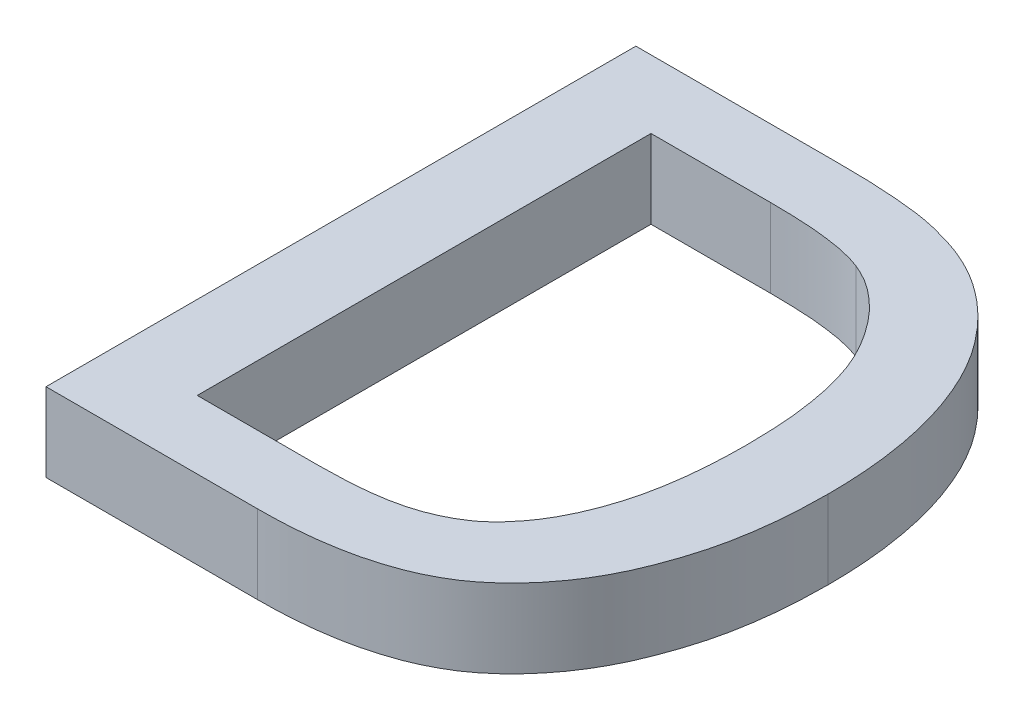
ISO-10303-21;
HEADER;
FILE_DESCRIPTION(('STEP AP214'),'2;1');
FILE_NAME('part.step','',(''),(''),'','','');
FILE_SCHEMA(('AUTOMOTIVE_DESIGN { 1 0 10303 214 1 1 1 1 }'));
ENDSEC;
DATA;
#1=APPLICATION_CONTEXT('core data for automotive mechanical design processes');
#2=APPLICATION_PROTOCOL_DEFINITION('international standard','automotive_design',2000,#1);
#3=PRODUCT_CONTEXT('',#1,'mechanical');
#4=PRODUCT('Part','Part','',(#3));
#5=PRODUCT_RELATED_PRODUCT_CATEGORY('part','',(#4));
#6=PRODUCT_DEFINITION_FORMATION('','',#4);
#7=PRODUCT_DEFINITION_CONTEXT('part definition',#1,'design');
#8=PRODUCT_DEFINITION('design','',#6,#7);
#9=PRODUCT_DEFINITION_SHAPE('','',#8);
#10=(LENGTH_UNIT() NAMED_UNIT(*) SI_UNIT(.MILLI.,.METRE.));
#11=(NAMED_UNIT(*) PLANE_ANGLE_UNIT() SI_UNIT($,.RADIAN.));
#12=(NAMED_UNIT(*) SI_UNIT($,.STERADIAN.) SOLID_ANGLE_UNIT());
#13=UNCERTAINTY_MEASURE_WITH_UNIT(LENGTH_MEASURE(1.E-05),#10,'distance_accuracy_value','');
#14=(GEOMETRIC_REPRESENTATION_CONTEXT(3) GLOBAL_UNCERTAINTY_ASSIGNED_CONTEXT((#13)) GLOBAL_UNIT_ASSIGNED_CONTEXT((#10,
#11,#12)) REPRESENTATION_CONTEXT('',''));
#15=CARTESIAN_POINT('',(0.,0.,0.));
#16=DIRECTION('',(0.,0.,1.));
#17=DIRECTION('',(1.,0.,0.));
#18=AXIS2_PLACEMENT_3D('',#15,#16,#17);
#19=CARTESIAN_POINT('',(4.25445931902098,6.60004762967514,-8.62210329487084));
#20=CARTESIAN_POINT('',(4.25445931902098,6.40004762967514,-8.62210329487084));
#21=CARTESIAN_POINT('',(4.24758374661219,6.60004762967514,-8.62461945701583));
#22=CARTESIAN_POINT('',(4.24758374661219,6.40004762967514,-8.62461945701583));
#23=CARTESIAN_POINT('',(4.23301485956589,6.60004762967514,-8.6299510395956));
#24=CARTESIAN_POINT('',(4.23301485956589,6.40004762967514,-8.6299510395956));
#25=CARTESIAN_POINT('',(4.20923702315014,6.60004762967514,-8.63598558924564));
#26=CARTESIAN_POINT('',(4.20923702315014,6.40004762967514,-8.63598558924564));
#27=CARTESIAN_POINT('',(4.18270071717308,6.60004762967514,-8.64153904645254));
#28=CARTESIAN_POINT('',(4.18270071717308,6.40004762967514,-8.64153904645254));
#29=CARTESIAN_POINT('',(4.15314438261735,6.60004762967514,-8.64543684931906));
#30=CARTESIAN_POINT('',(4.15314438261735,6.40004762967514,-8.64543684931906));
#31=CARTESIAN_POINT('',(4.1207174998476,6.60004762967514,-8.64922508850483));
#32=CARTESIAN_POINT('',(4.1207174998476,6.40004762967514,-8.64922508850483));
#33=CARTESIAN_POINT('',(4.08521850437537,6.60004762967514,-8.65152712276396));
#34=CARTESIAN_POINT('',(4.08521850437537,6.40004762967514,-8.65152712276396));
#35=CARTESIAN_POINT('',(4.04683357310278,6.60004762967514,-8.652570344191));
#36=CARTESIAN_POINT('',(4.04683357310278,6.40004762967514,-8.652570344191));
#37=CARTESIAN_POINT('',(4.02028517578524,6.60004762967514,-8.6528884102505));
#38=CARTESIAN_POINT('',(4.02028517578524,6.40004762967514,-8.6528884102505));
#39=CARTESIAN_POINT('',(4.0065626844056,6.60004762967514,-8.65305281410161));
#40=CARTESIAN_POINT('',(4.0065626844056,6.40004762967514,-8.65305281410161));
#41=(BOUNDED_SURFACE() B_SPLINE_SURFACE(3,1,((#19,#20),(#21,#22),(#23,#24),(#25,#26),(#27,#28),
(#29,#30),(#31,#32),(#33,#34),(#35,#36),(#37,#38),(#39,#40)),.UNSPECIFIED.,.F.,.F.,
.F.) B_SPLINE_SURFACE_WITH_KNOTS((4,1,1,1,1,1,1,1,4),(2,2),(0.,0.0874250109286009,
0.18524786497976,0.292738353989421,0.411206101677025,0.541245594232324,0.682780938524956,
0.836033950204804,1.),(0.,1.),
.UNSPECIFIED.) GEOMETRIC_REPRESENTATION_ITEM() RATIONAL_B_SPLINE_SURFACE(((1.,1.),(1.,1.),(1.,
1.),(1.,1.),(1.,1.),(1.,1.),(1.,1.),(1.,1.),(1.,1.),(1.,1.),(1.,1.))) REPRESENTATION_ITEM('') SURFACE());
#42=CARTESIAN_POINT('',(4.25445931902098,6.40004762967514,-8.62210329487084));
#43=CARTESIAN_POINT('',(4.24758374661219,6.40004762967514,-8.62461945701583));
#44=CARTESIAN_POINT('',(4.23301485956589,6.40004762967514,-8.6299510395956));
#45=CARTESIAN_POINT('',(4.20923702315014,6.40004762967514,-8.63598558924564));
#46=CARTESIAN_POINT('',(4.18270071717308,6.40004762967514,-8.64153904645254));
#47=CARTESIAN_POINT('',(4.15314438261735,6.40004762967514,-8.64543684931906));
#48=CARTESIAN_POINT('',(4.1207174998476,6.40004762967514,-8.64922508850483));
#49=CARTESIAN_POINT('',(4.08521850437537,6.40004762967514,-8.65152712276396));
#50=CARTESIAN_POINT('',(4.04683357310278,6.40004762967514,-8.652570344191));
#51=CARTESIAN_POINT('',(4.02028517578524,6.40004762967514,-8.6528884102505));
#52=CARTESIAN_POINT('',(4.0065626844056,6.40004762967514,-8.65305281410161));
#53=(BOUNDED_CURVE() B_SPLINE_CURVE(3,(#42,#43,#44,#45,#46,#47,#48,#49,#50,#51,#52),
.UNSPECIFIED.,.F.,.F.) B_SPLINE_CURVE_WITH_KNOTS((4,1,1,1,1,1,1,1,4),(0.,0.0874250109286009,
0.18524786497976,0.292738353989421,0.411206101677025,0.541245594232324,0.682780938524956,
0.836033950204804,1.),
.UNSPECIFIED.) CURVE() GEOMETRIC_REPRESENTATION_ITEM() RATIONAL_B_SPLINE_CURVE((1.,1.,1.,1.,1.,
1.,1.,1.,1.,1.,1.)) REPRESENTATION_ITEM(''));
#54=CARTESIAN_POINT('',(4.25445931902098,6.40004762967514,-8.62210329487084));
#55=VERTEX_POINT('',#54);
#56=CARTESIAN_POINT('',(4.0065626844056,6.40004762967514,-8.65305281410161));
#57=VERTEX_POINT('',#56);
#58=EDGE_CURVE('E162',#55,#57,#53,.T.);
#59=DIRECTION('',(0.,-1.,0.));
#60=VECTOR('',#59,1.);
#61=CARTESIAN_POINT('',(4.25445931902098,6.60004762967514,-8.62210329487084));
#62=LINE('',#61,#60);
#63=CARTESIAN_POINT('',(4.25445931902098,6.60004762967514,-8.62210329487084));
#64=VERTEX_POINT('',#63);
#65=EDGE_CURVE('E11',#64,#55,#62,.T.);
#66=CARTESIAN_POINT('',(4.25445931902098,6.60004762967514,-8.62210329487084));
#67=CARTESIAN_POINT('',(4.24758374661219,6.60004762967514,-8.62461945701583));
#68=CARTESIAN_POINT('',(4.23301485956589,6.60004762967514,-8.6299510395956));
#69=CARTESIAN_POINT('',(4.20923702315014,6.60004762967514,-8.63598558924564));
#70=CARTESIAN_POINT('',(4.18270071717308,6.60004762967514,-8.64153904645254));
#71=CARTESIAN_POINT('',(4.15314438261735,6.60004762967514,-8.64543684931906));
#72=CARTESIAN_POINT('',(4.1207174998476,6.60004762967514,-8.64922508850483));
#73=CARTESIAN_POINT('',(4.08521850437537,6.60004762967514,-8.65152712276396));
#74=CARTESIAN_POINT('',(4.04683357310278,6.60004762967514,-8.652570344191));
#75=CARTESIAN_POINT('',(4.02028517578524,6.60004762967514,-8.6528884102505));
#76=CARTESIAN_POINT('',(4.0065626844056,6.60004762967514,-8.65305281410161));
#77=(BOUNDED_CURVE() B_SPLINE_CURVE(3,(#66,#67,#68,#69,#70,#71,#72,#73,#74,#75,#76),
.UNSPECIFIED.,.F.,.F.) B_SPLINE_CURVE_WITH_KNOTS((4,1,1,1,1,1,1,1,4),(0.,0.0874250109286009,
0.18524786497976,0.292738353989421,0.411206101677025,0.541245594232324,0.682780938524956,
0.836033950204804,1.),
.UNSPECIFIED.) CURVE() GEOMETRIC_REPRESENTATION_ITEM() RATIONAL_B_SPLINE_CURVE((1.,1.,1.,1.,1.,
1.,1.,1.,1.,1.,1.)) REPRESENTATION_ITEM(''));
#78=CARTESIAN_POINT('',(4.0065626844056,6.60004762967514,-8.65305281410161));
#79=VERTEX_POINT('',#78);
#80=EDGE_CURVE('E252',#64,#79,#77,.T.);
#81=DIRECTION('',(0.,-1.,0.));
#82=VECTOR('',#81,1.);
#83=CARTESIAN_POINT('',(4.0065626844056,6.60004762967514,-8.65305281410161));
#84=LINE('',#83,#82);
#85=EDGE_CURVE('E200',#79,#57,#84,.T.);
#86=ORIENTED_EDGE('',*,*,#58,.F.);
#87=ORIENTED_EDGE('',*,*,#65,.F.);
#88=ORIENTED_EDGE('',*,*,#80,.T.);
#89=ORIENTED_EDGE('',*,*,#85,.T.);
#90=EDGE_LOOP('',(#86,#87,#88,#89));
#91=FACE_BOUND('',#90,.T.);
#92=ADVANCED_FACE('F16',(#91),#41,.T.);
#93=CARTESIAN_POINT('',(4.51016845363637,6.60004762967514,-8.0875480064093));
#94=CARTESIAN_POINT('',(4.51016845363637,6.40004762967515,-8.0875480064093));
#95=CARTESIAN_POINT('',(4.50991189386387,6.60004762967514,-8.10668177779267));
#96=CARTESIAN_POINT('',(4.50991189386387,6.40004762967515,-8.10668177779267));
#97=CARTESIAN_POINT('',(4.5094131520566,6.60004762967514,-8.14387705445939));
#98=CARTESIAN_POINT('',(4.5094131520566,6.40004762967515,-8.14387705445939));
#99=CARTESIAN_POINT('',(4.50630392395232,6.60004762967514,-8.19806433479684));
#100=CARTESIAN_POINT('',(4.50630392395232,6.40004762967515,-8.19806433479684));
#101=CARTESIAN_POINT('',(4.50016585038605,6.60004762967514,-8.24877820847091));
#102=CARTESIAN_POINT('',(4.50016585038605,6.40004762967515,-8.24877820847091));
#103=CARTESIAN_POINT('',(4.49231582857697,6.60004762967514,-8.29610639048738));
#104=CARTESIAN_POINT('',(4.49231582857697,6.40004762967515,-8.29610639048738));
#105=CARTESIAN_POINT('',(4.48159785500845,6.60004762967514,-8.33989843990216));
#106=CARTESIAN_POINT('',(4.48159785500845,6.40004762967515,-8.33989843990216));
#107=CARTESIAN_POINT('',(4.46934166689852,6.60004762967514,-8.3805739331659));
#108=CARTESIAN_POINT('',(4.46934166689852,6.40004762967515,-8.3805739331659));
#109=CARTESIAN_POINT('',(4.4539229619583,6.60004762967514,-8.41760114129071));
#110=CARTESIAN_POINT('',(4.4539229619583,6.40004762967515,-8.41760114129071));
#111=CARTESIAN_POINT('',(4.43632832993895,6.60004762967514,-8.45126591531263));
#112=CARTESIAN_POINT('',(4.43632832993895,6.40004762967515,-8.45126591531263));
#113=CARTESIAN_POINT('',(4.41702681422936,6.60004762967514,-8.48179182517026));
#114=CARTESIAN_POINT('',(4.41702681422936,6.40004762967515,-8.48179182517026));
#115=CARTESIAN_POINT('',(4.39691394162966,6.60004762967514,-8.50983454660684));
#116=CARTESIAN_POINT('',(4.39691394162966,6.40004762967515,-8.50983454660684));
#117=CARTESIAN_POINT('',(4.3758867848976,6.60004762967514,-8.53530213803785));
#118=CARTESIAN_POINT('',(4.3758867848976,6.40004762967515,-8.53530213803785));
#119=CARTESIAN_POINT('',(4.35349979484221,6.60004762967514,-8.55783224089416));
#120=CARTESIAN_POINT('',(4.35349979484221,6.40004762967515,-8.55783224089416));
#121=CARTESIAN_POINT('',(4.33042595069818,6.60004762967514,-8.5780911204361));
#122=CARTESIAN_POINT('',(4.33042595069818,6.40004762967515,-8.5780911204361));
#123=CARTESIAN_POINT('',(4.30623509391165,6.60004762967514,-8.59566400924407));
#124=CARTESIAN_POINT('',(4.30623509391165,6.40004762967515,-8.59566400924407));
#125=CARTESIAN_POINT('',(4.28099491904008,6.60004762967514,-8.61054550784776));
#126=CARTESIAN_POINT('',(4.28099491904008,6.40004762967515,-8.61054550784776));
#127=CARTESIAN_POINT('',(4.26325880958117,6.60004762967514,-8.61827060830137));
#128=CARTESIAN_POINT('',(4.26325880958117,6.40004762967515,-8.61827060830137));
#129=CARTESIAN_POINT('',(4.25445931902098,6.60004762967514,-8.62210329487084));
#130=CARTESIAN_POINT('',(4.25445931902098,6.40004762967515,-8.62210329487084));
#131=(BOUNDED_SURFACE() B_SPLINE_SURFACE(3,1,((#93,#94),(#95,#96),(#97,#98),(#99,#100),(#101,
#102),(#103,#104),(#105,#106),(#107,#108),(#109,#110),(#111,#112),(#113,#114),(#115,#116),(#117,
#118),(#119,#120),(#121,#122),(#123,#124),(#125,#126),(#127,#128),(#129,#130)),.UNSPECIFIED.,
.F.,.F.,.F.) B_SPLINE_SURFACE_WITH_KNOTS((4,1,1,1,1,1,1,1,1,1,1,1,1,1,1,1,4),(2,2),(0.,
0.0912579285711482,0.177401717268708,0.258693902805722,0.334791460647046,0.406045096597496,
0.473581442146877,0.537187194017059,0.597012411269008,0.654533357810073,0.709286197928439,
0.76151799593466,0.811847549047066,0.860604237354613,0.907805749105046,0.954259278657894,1.),
(0.,1.),.UNSPECIFIED.) GEOMETRIC_REPRESENTATION_ITEM() RATIONAL_B_SPLINE_SURFACE(((1.,1.),(1.,
1.),(1.,1.),(1.,1.),(1.,1.),(1.,1.),(1.,1.),(1.,1.),(1.,1.),(1.,1.),(1.,1.),(1.,1.),(1.,1.),(1.,
1.),(1.,1.),(1.,1.),(1.,1.),(1.,1.),(1.,1.))) REPRESENTATION_ITEM('') SURFACE());
#132=CARTESIAN_POINT('',(4.51016845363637,6.40004762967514,-8.0875480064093));
#133=CARTESIAN_POINT('',(4.50991189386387,6.40004762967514,-8.10668177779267));
#134=CARTESIAN_POINT('',(4.5094131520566,6.40004762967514,-8.14387705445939));
#135=CARTESIAN_POINT('',(4.50630392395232,6.40004762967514,-8.19806433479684));
#136=CARTESIAN_POINT('',(4.50016585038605,6.40004762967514,-8.24877820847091));
#137=CARTESIAN_POINT('',(4.49231582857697,6.40004762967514,-8.29610639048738));
#138=CARTESIAN_POINT('',(4.48159785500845,6.40004762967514,-8.33989843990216));
#139=CARTESIAN_POINT('',(4.46934166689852,6.40004762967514,-8.3805739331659));
#140=CARTESIAN_POINT('',(4.4539229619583,6.40004762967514,-8.41760114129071));
#141=CARTESIAN_POINT('',(4.43632832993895,6.40004762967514,-8.45126591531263));
#142=CARTESIAN_POINT('',(4.41702681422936,6.40004762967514,-8.48179182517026));
#143=CARTESIAN_POINT('',(4.39691394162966,6.40004762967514,-8.50983454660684));
#144=CARTESIAN_POINT('',(4.3758867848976,6.40004762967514,-8.53530213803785));
#145=CARTESIAN_POINT('',(4.35349979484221,6.40004762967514,-8.55783224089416));
#146=CARTESIAN_POINT('',(4.33042595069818,6.40004762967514,-8.5780911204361));
#147=CARTESIAN_POINT('',(4.30623509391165,6.40004762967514,-8.59566400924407));
#148=CARTESIAN_POINT('',(4.28099491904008,6.40004762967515,-8.61054550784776));
#149=CARTESIAN_POINT('',(4.26325880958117,6.40004762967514,-8.61827060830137));
#150=CARTESIAN_POINT('',(4.25445931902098,6.40004762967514,-8.62210329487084));
#151=(BOUNDED_CURVE() B_SPLINE_CURVE(3,(#132,#133,#134,#135,#136,#137,#138,#139,#140,#141,#142,
#143,#144,#145,#146,#147,#148,#149,#150),.UNSPECIFIED.,.F.,.F.) B_SPLINE_CURVE_WITH_KNOTS((4,1,
1,1,1,1,1,1,1,1,1,1,1,1,1,1,4),(0.,0.0912579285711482,0.177401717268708,0.258693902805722,
0.334791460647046,0.406045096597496,0.473581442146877,0.537187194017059,0.597012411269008,
0.654533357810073,0.709286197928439,0.76151799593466,0.811847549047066,0.860604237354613,
0.907805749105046,0.954259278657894,1.),
.UNSPECIFIED.) CURVE() GEOMETRIC_REPRESENTATION_ITEM() RATIONAL_B_SPLINE_CURVE((1.,1.,1.,1.,1.,
1.,1.,1.,1.,1.,1.,1.,1.,1.,1.,1.,1.,1.,1.)) REPRESENTATION_ITEM(''));
#152=CARTESIAN_POINT('',(4.51016845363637,6.40004762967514,-8.0875480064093));
#153=VERTEX_POINT('',#152);
#154=EDGE_CURVE('E347',#153,#55,#151,.T.);
#155=DIRECTION('',(0.,-1.,0.));
#156=VECTOR('',#155,1.);
#157=CARTESIAN_POINT('',(4.51016845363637,6.60004762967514,-8.0875480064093));
#158=LINE('',#157,#156);
#159=CARTESIAN_POINT('',(4.51016845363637,6.60004762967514,-8.0875480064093));
#160=VERTEX_POINT('',#159);
#161=EDGE_CURVE('E26',#160,#153,#158,.T.);
#162=CARTESIAN_POINT('',(4.51016845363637,6.60004762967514,-8.0875480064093));
#163=CARTESIAN_POINT('',(4.50991189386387,6.60004762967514,-8.10668177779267));
#164=CARTESIAN_POINT('',(4.5094131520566,6.60004762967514,-8.14387705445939));
#165=CARTESIAN_POINT('',(4.50630392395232,6.60004762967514,-8.19806433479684));
#166=CARTESIAN_POINT('',(4.50016585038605,6.60004762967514,-8.24877820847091));
#167=CARTESIAN_POINT('',(4.49231582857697,6.60004762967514,-8.29610639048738));
#168=CARTESIAN_POINT('',(4.48159785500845,6.60004762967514,-8.33989843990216));
#169=CARTESIAN_POINT('',(4.46934166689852,6.60004762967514,-8.3805739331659));
#170=CARTESIAN_POINT('',(4.4539229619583,6.60004762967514,-8.41760114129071));
#171=CARTESIAN_POINT('',(4.43632832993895,6.60004762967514,-8.45126591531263));
#172=CARTESIAN_POINT('',(4.41702681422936,6.60004762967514,-8.48179182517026));
#173=CARTESIAN_POINT('',(4.39691394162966,6.60004762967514,-8.50983454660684));
#174=CARTESIAN_POINT('',(4.3758867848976,6.60004762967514,-8.53530213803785));
#175=CARTESIAN_POINT('',(4.35349979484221,6.60004762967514,-8.55783224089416));
#176=CARTESIAN_POINT('',(4.33042595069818,6.60004762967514,-8.5780911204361));
#177=CARTESIAN_POINT('',(4.30623509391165,6.60004762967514,-8.59566400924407));
#178=CARTESIAN_POINT('',(4.28099491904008,6.60004762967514,-8.61054550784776));
#179=CARTESIAN_POINT('',(4.26325880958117,6.60004762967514,-8.61827060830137));
#180=CARTESIAN_POINT('',(4.25445931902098,6.60004762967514,-8.62210329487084));
#181=(BOUNDED_CURVE() B_SPLINE_CURVE(3,(#162,#163,#164,#165,#166,#167,#168,#169,#170,#171,#172,
#173,#174,#175,#176,#177,#178,#179,#180),.UNSPECIFIED.,.F.,.F.) B_SPLINE_CURVE_WITH_KNOTS((4,1,
1,1,1,1,1,1,1,1,1,1,1,1,1,1,4),(0.,0.0912579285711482,0.177401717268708,0.258693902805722,
0.334791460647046,0.406045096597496,0.473581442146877,0.537187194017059,0.597012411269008,
0.654533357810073,0.709286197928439,0.76151799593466,0.811847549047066,0.860604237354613,
0.907805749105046,0.954259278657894,1.),
.UNSPECIFIED.) CURVE() GEOMETRIC_REPRESENTATION_ITEM() RATIONAL_B_SPLINE_CURVE((1.,1.,1.,1.,1.,
1.,1.,1.,1.,1.,1.,1.,1.,1.,1.,1.,1.,1.,1.)) REPRESENTATION_ITEM(''));
#182=EDGE_CURVE('E266',#160,#64,#181,.T.);
#183=ORIENTED_EDGE('',*,*,#154,.F.);
#184=ORIENTED_EDGE('',*,*,#161,.F.);
#185=ORIENTED_EDGE('',*,*,#182,.T.);
#186=ORIENTED_EDGE('',*,*,#65,.T.);
#187=EDGE_LOOP('',(#183,#184,#185,#186));
#188=FACE_BOUND('',#187,.T.);
#189=ADVANCED_FACE('F396',(#188),#131,.T.);
#190=CARTESIAN_POINT('',(4.3659376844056,6.60004762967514,-7.60527637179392));
#191=CARTESIAN_POINT('',(4.3659376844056,6.40004762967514,-7.60527637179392));
#192=CARTESIAN_POINT('',(4.37700370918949,6.60004762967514,-7.61792953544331));
#193=CARTESIAN_POINT('',(4.37700370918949,6.40004762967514,-7.61792953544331));
#194=CARTESIAN_POINT('',(4.39973713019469,6.60004762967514,-7.64392348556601));
#195=CARTESIAN_POINT('',(4.39973713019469,6.40004762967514,-7.64392348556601));
#196=CARTESIAN_POINT('',(4.42804613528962,6.60004762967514,-7.68933353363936));
#197=CARTESIAN_POINT('',(4.42804613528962,6.40004762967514,-7.68933353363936));
#198=CARTESIAN_POINT('',(4.45273296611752,6.60004762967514,-7.74042853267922));
#199=CARTESIAN_POINT('',(4.45273296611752,6.40004762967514,-7.74042853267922));
#200=CARTESIAN_POINT('',(4.47336975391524,6.60004762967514,-7.79775242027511));
#201=CARTESIAN_POINT('',(4.47336975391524,6.40004762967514,-7.79775242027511));
#202=CARTESIAN_POINT('',(4.4902913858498,6.60004762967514,-7.86111130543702));
#203=CARTESIAN_POINT('',(4.4902913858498,6.40004762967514,-7.86111130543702));
#204=CARTESIAN_POINT('',(4.50157746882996,6.60004762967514,-7.93107270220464));
#205=CARTESIAN_POINT('',(4.50157746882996,6.40004762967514,-7.93107270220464));
#206=CARTESIAN_POINT('',(4.50895640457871,6.60004762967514,-8.00716090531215));
#207=CARTESIAN_POINT('',(4.50895640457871,6.40004762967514,-8.00716090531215));
#208=CARTESIAN_POINT('',(4.50975437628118,6.60004762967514,-8.06008502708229));
#209=CARTESIAN_POINT('',(4.50975437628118,6.40004762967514,-8.06008502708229));
#210=CARTESIAN_POINT('',(4.51016845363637,6.60004762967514,-8.0875480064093));
#211=CARTESIAN_POINT('',(4.51016845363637,6.40004762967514,-8.0875480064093));
#212=(BOUNDED_SURFACE() B_SPLINE_SURFACE(3,1,((#190,#191),(#192,#193),(#194,#195),(#196,#197),
(#198,#199),(#200,#201),(#202,#203),(#204,#205),(#206,#207),(#208,#209),(#210,#211)),
.UNSPECIFIED.,.F.,.F.,.F.) B_SPLINE_SURFACE_WITH_KNOTS((4,1,1,1,1,1,1,1,4),(2,2),(0.,
0.0977730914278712,0.200859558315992,0.31044138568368,0.427816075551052,0.555168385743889,
0.691833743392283,0.84008872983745,1.),(0.,1.),
.UNSPECIFIED.) GEOMETRIC_REPRESENTATION_ITEM() RATIONAL_B_SPLINE_SURFACE(((1.,1.),(1.,1.),(1.,
1.),(1.,1.),(1.,1.),(1.,1.),(1.,1.),(1.,1.),(1.,1.),(1.,1.),(1.,1.))) REPRESENTATION_ITEM('') SURFACE());
#213=CARTESIAN_POINT('',(4.3659376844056,6.40004762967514,-7.60527637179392));
#214=CARTESIAN_POINT('',(4.37700370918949,6.40004762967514,-7.61792953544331));
#215=CARTESIAN_POINT('',(4.39973713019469,6.40004762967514,-7.64392348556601));
#216=CARTESIAN_POINT('',(4.42804613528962,6.40004762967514,-7.68933353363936));
#217=CARTESIAN_POINT('',(4.45273296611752,6.40004762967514,-7.74042853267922));
#218=CARTESIAN_POINT('',(4.47336975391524,6.40004762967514,-7.79775242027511));
#219=CARTESIAN_POINT('',(4.4902913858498,6.40004762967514,-7.86111130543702));
#220=CARTESIAN_POINT('',(4.50157746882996,6.40004762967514,-7.93107270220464));
#221=CARTESIAN_POINT('',(4.50895640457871,6.40004762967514,-8.00716090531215));
#222=CARTESIAN_POINT('',(4.50975437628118,6.40004762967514,-8.06008502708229));
#223=CARTESIAN_POINT('',(4.51016845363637,6.40004762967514,-8.0875480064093));
#224=(BOUNDED_CURVE() B_SPLINE_CURVE(3,(#213,#214,#215,#216,#217,#218,#219,#220,#221,#222,#223),
.UNSPECIFIED.,.F.,.F.) B_SPLINE_CURVE_WITH_KNOTS((4,1,1,1,1,1,1,1,4),(0.,0.0977730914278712,
0.200859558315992,0.31044138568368,0.427816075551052,0.555168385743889,0.691833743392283,
0.84008872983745,1.),
.UNSPECIFIED.) CURVE() GEOMETRIC_REPRESENTATION_ITEM() RATIONAL_B_SPLINE_CURVE((1.,1.,1.,1.,1.,
1.,1.,1.,1.,1.,1.)) REPRESENTATION_ITEM(''));
#225=CARTESIAN_POINT('',(4.3659376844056,6.40004762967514,-7.60527637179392));
#226=VERTEX_POINT('',#225);
#227=EDGE_CURVE('E338',#226,#153,#224,.T.);
#228=DIRECTION('',(0.,-1.,0.));
#229=VECTOR('',#228,1.);
#230=CARTESIAN_POINT('',(4.3659376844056,6.60004762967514,-7.60527637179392));
#231=LINE('',#230,#229);
#232=CARTESIAN_POINT('',(4.3659376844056,6.60004762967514,-7.60527637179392));
#233=VERTEX_POINT('',#232);
#234=EDGE_CURVE('E259',#233,#226,#231,.T.);
#235=CARTESIAN_POINT('',(4.3659376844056,6.60004762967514,-7.60527637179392));
#236=CARTESIAN_POINT('',(4.37700370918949,6.60004762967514,-7.61792953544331));
#237=CARTESIAN_POINT('',(4.39973713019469,6.60004762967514,-7.64392348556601));
#238=CARTESIAN_POINT('',(4.42804613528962,6.60004762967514,-7.68933353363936));
#239=CARTESIAN_POINT('',(4.45273296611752,6.60004762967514,-7.74042853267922));
#240=CARTESIAN_POINT('',(4.47336975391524,6.60004762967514,-7.79775242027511));
#241=CARTESIAN_POINT('',(4.4902913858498,6.60004762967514,-7.86111130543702));
#242=CARTESIAN_POINT('',(4.50157746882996,6.60004762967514,-7.93107270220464));
#243=CARTESIAN_POINT('',(4.50895640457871,6.60004762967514,-8.00716090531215));
#244=CARTESIAN_POINT('',(4.50975437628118,6.60004762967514,-8.06008502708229));
#245=CARTESIAN_POINT('',(4.51016845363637,6.60004762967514,-8.0875480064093));
#246=(BOUNDED_CURVE() B_SPLINE_CURVE(3,(#235,#236,#237,#238,#239,#240,#241,#242,#243,#244,#245),
.UNSPECIFIED.,.F.,.F.) B_SPLINE_CURVE_WITH_KNOTS((4,1,1,1,1,1,1,1,4),(0.,0.0977730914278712,
0.200859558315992,0.31044138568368,0.427816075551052,0.555168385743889,0.691833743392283,
0.84008872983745,1.),
.UNSPECIFIED.) CURVE() GEOMETRIC_REPRESENTATION_ITEM() RATIONAL_B_SPLINE_CURVE((1.,1.,1.,1.,1.,
1.,1.,1.,1.,1.,1.)) REPRESENTATION_ITEM(''));
#247=EDGE_CURVE('E245',#233,#160,#246,.T.);
#248=ORIENTED_EDGE('',*,*,#227,.F.);
#249=ORIENTED_EDGE('',*,*,#234,.F.);
#250=ORIENTED_EDGE('',*,*,#247,.T.);
#251=ORIENTED_EDGE('',*,*,#161,.T.);
#252=EDGE_LOOP('',(#248,#249,#250,#251));
#253=FACE_BOUND('',#252,.T.);
#254=ADVANCED_FACE('F390',(#253),#212,.T.);
#255=CARTESIAN_POINT('',(4.01167085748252,6.60004762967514,-7.49920666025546));
#256=CARTESIAN_POINT('',(4.01167085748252,6.40004762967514,-7.49920666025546));
#257=CARTESIAN_POINT('',(4.03421656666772,6.60004762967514,-7.49954416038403));
#258=CARTESIAN_POINT('',(4.03421656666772,6.40004762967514,-7.49954416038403));
#259=CARTESIAN_POINT('',(4.07686802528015,6.60004762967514,-7.50018263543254));
#260=CARTESIAN_POINT('',(4.07686802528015,6.40004762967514,-7.50018263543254));
#261=CARTESIAN_POINT('',(4.13704249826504,6.60004762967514,-7.50508610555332));
#262=CARTESIAN_POINT('',(4.13704249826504,6.40004762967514,-7.50508610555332));
#263=CARTESIAN_POINT('',(4.18956094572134,6.60004762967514,-7.51354393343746));
#264=CARTESIAN_POINT('',(4.18956094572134,6.40004762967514,-7.51354393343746));
#265=CARTESIAN_POINT('',(4.23500574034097,6.60004762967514,-7.52557713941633));
#266=CARTESIAN_POINT('',(4.23500574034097,6.40004762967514,-7.52557713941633));
#267=CARTESIAN_POINT('',(4.27443619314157,6.60004762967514,-7.54113792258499));
#268=CARTESIAN_POINT('',(4.27443619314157,6.40004762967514,-7.54113792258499));
#269=CARTESIAN_POINT('',(4.30915489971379,6.60004762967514,-7.55953448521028));
#270=CARTESIAN_POINT('',(4.30915489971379,6.40004762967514,-7.55953448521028));
#271=CARTESIAN_POINT('',(4.34003762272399,6.60004762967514,-7.58041044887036));
#272=CARTESIAN_POINT('',(4.34003762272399,6.40004762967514,-7.58041044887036));
#273=CARTESIAN_POINT('',(4.35743386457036,6.60004762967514,-7.59711209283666));
#274=CARTESIAN_POINT('',(4.35743386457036,6.40004762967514,-7.59711209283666));
#275=CARTESIAN_POINT('',(4.3659376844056,6.60004762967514,-7.60527637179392));
#276=CARTESIAN_POINT('',(4.3659376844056,6.40004762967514,-7.60527637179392));
#277=(BOUNDED_SURFACE() B_SPLINE_SURFACE(3,1,((#255,#256),(#257,#258),(#259,#260),(#261,#262),
(#263,#264),(#265,#266),(#267,#268),(#269,#270),(#271,#272),(#273,#274),(#275,#276)),
.UNSPECIFIED.,.F.,.F.,.F.) B_SPLINE_SURFACE_WITH_KNOTS((4,1,1,1,1,1,1,1,4),(2,2),(0.,
0.177956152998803,0.336653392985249,0.476121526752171,0.597333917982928,0.707007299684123,
0.809929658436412,0.907087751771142,1.),(0.,1.),
.UNSPECIFIED.) GEOMETRIC_REPRESENTATION_ITEM() RATIONAL_B_SPLINE_SURFACE(((1.,1.),(1.,1.),(1.,
1.),(1.,1.),(1.,1.),(1.,1.),(1.,1.),(1.,1.),(1.,1.),(1.,1.),(1.,1.))) REPRESENTATION_ITEM('') SURFACE());
#278=CARTESIAN_POINT('',(4.01167085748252,6.40004762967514,-7.49920666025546));
#279=CARTESIAN_POINT('',(4.03421656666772,6.40004762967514,-7.49954416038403));
#280=CARTESIAN_POINT('',(4.07686802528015,6.40004762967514,-7.50018263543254));
#281=CARTESIAN_POINT('',(4.13704249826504,6.40004762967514,-7.50508610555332));
#282=CARTESIAN_POINT('',(4.18956094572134,6.40004762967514,-7.51354393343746));
#283=CARTESIAN_POINT('',(4.23500574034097,6.40004762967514,-7.52557713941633));
#284=CARTESIAN_POINT('',(4.27443619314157,6.40004762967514,-7.54113792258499));
#285=CARTESIAN_POINT('',(4.30915489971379,6.40004762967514,-7.55953448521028));
#286=CARTESIAN_POINT('',(4.34003762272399,6.40004762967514,-7.58041044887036));
#287=CARTESIAN_POINT('',(4.35743386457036,6.40004762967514,-7.59711209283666));
#288=CARTESIAN_POINT('',(4.3659376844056,6.40004762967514,-7.60527637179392));
#289=(BOUNDED_CURVE() B_SPLINE_CURVE(3,(#278,#279,#280,#281,#282,#283,#284,#285,#286,#287,#288),
.UNSPECIFIED.,.F.,.F.) B_SPLINE_CURVE_WITH_KNOTS((4,1,1,1,1,1,1,1,4),(0.,0.177956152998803,
0.336653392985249,0.476121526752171,0.597333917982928,0.707007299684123,0.809929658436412,
0.907087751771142,1.),
.UNSPECIFIED.) CURVE() GEOMETRIC_REPRESENTATION_ITEM() RATIONAL_B_SPLINE_CURVE((1.,1.,1.,1.,1.,
1.,1.,1.,1.,1.,1.)) REPRESENTATION_ITEM(''));
#290=CARTESIAN_POINT('',(4.01167085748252,6.40004762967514,-7.49920666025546));
#291=VERTEX_POINT('',#290);
#292=EDGE_CURVE('E332',#291,#226,#289,.T.);
#293=DIRECTION('',(0.,-1.,0.));
#294=VECTOR('',#293,1.);
#295=CARTESIAN_POINT('',(4.01167085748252,6.60004762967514,-7.49920666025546));
#296=LINE('',#295,#294);
#297=CARTESIAN_POINT('',(4.01167085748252,6.60004762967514,-7.49920666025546));
#298=VERTEX_POINT('',#297);
#299=EDGE_CURVE('E256',#298,#291,#296,.T.);
#300=CARTESIAN_POINT('',(4.01167085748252,6.60004762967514,-7.49920666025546));
#301=CARTESIAN_POINT('',(4.03421656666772,6.60004762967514,-7.49954416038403));
#302=CARTESIAN_POINT('',(4.07686802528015,6.60004762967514,-7.50018263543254));
#303=CARTESIAN_POINT('',(4.13704249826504,6.60004762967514,-7.50508610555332));
#304=CARTESIAN_POINT('',(4.18956094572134,6.60004762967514,-7.51354393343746));
#305=CARTESIAN_POINT('',(4.23500574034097,6.60004762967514,-7.52557713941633));
#306=CARTESIAN_POINT('',(4.27443619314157,6.60004762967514,-7.54113792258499));
#307=CARTESIAN_POINT('',(4.30915489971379,6.60004762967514,-7.55953448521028));
#308=CARTESIAN_POINT('',(4.34003762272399,6.60004762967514,-7.58041044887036));
#309=CARTESIAN_POINT('',(4.35743386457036,6.60004762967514,-7.59711209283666));
#310=CARTESIAN_POINT('',(4.3659376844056,6.60004762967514,-7.60527637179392));
#311=(BOUNDED_CURVE() B_SPLINE_CURVE(3,(#300,#301,#302,#303,#304,#305,#306,#307,#308,#309,#310),
.UNSPECIFIED.,.F.,.F.) B_SPLINE_CURVE_WITH_KNOTS((4,1,1,1,1,1,1,1,4),(0.,0.177956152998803,
0.336653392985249,0.476121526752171,0.597333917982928,0.707007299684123,0.809929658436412,
0.907087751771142,1.),
.UNSPECIFIED.) CURVE() GEOMETRIC_REPRESENTATION_ITEM() RATIONAL_B_SPLINE_CURVE((1.,1.,1.,1.,1.,
1.,1.,1.,1.,1.,1.)) REPRESENTATION_ITEM(''));
#312=EDGE_CURVE('E238',#298,#233,#311,.T.);
#313=ORIENTED_EDGE('',*,*,#292,.F.);
#314=ORIENTED_EDGE('',*,*,#299,.F.);
#315=ORIENTED_EDGE('',*,*,#312,.T.);
#316=ORIENTED_EDGE('',*,*,#234,.T.);
#317=EDGE_LOOP('',(#313,#314,#315,#316));
#318=FACE_BOUND('',#317,.T.);
#319=ADVANCED_FACE('F395',(#318),#277,.T.);
#320=CARTESIAN_POINT('',(0.,6.60004762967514,-7.49920666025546));
#321=DIRECTION('',(0.,0.,-1.));
#322=DIRECTION('',(0.,-1.,0.));
#323=AXIS2_PLACEMENT_3D('',#320,#321,#322);
#324=PLANE('',#323);
#325=DIRECTION('',(1.,0.,0.));
#326=VECTOR('',#325,1.);
#327=CARTESIAN_POINT('',(0.,6.40004762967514,-7.49920666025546));
#328=LINE('',#327,#326);
#329=CARTESIAN_POINT('',(3.70247614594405,6.40004762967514,-7.49920666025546));
#330=VERTEX_POINT('',#329);
#331=EDGE_CURVE('E328',#330,#291,#328,.T.);
#332=ORIENTED_EDGE('',*,*,#331,.F.);
#333=DIRECTION('',(0.,-1.,0.));
#334=VECTOR('',#333,1.);
#335=CARTESIAN_POINT('',(3.70247614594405,6.60004762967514,-7.49920666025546));
#336=LINE('',#335,#334);
#337=CARTESIAN_POINT('',(3.70247614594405,6.60004762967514,-7.49920666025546));
#338=VERTEX_POINT('',#337);
#339=EDGE_CURVE('E260',#338,#330,#336,.T.);
#340=ORIENTED_EDGE('',*,*,#339,.F.);
#341=DIRECTION('',(1.,0.,0.));
#342=VECTOR('',#341,1.);
#343=CARTESIAN_POINT('',(0.,6.60004762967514,-7.49920666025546));
#344=LINE('',#343,#342);
#345=EDGE_CURVE('E244',#338,#298,#344,.T.);
#346=ORIENTED_EDGE('',*,*,#345,.T.);
#347=ORIENTED_EDGE('',*,*,#299,.T.);
#348=EDGE_LOOP('',(#332,#340,#346,#347));
#349=FACE_BOUND('',#348,.T.);
#350=ADVANCED_FACE('F418',(#349),#324,.T.);
#351=CARTESIAN_POINT('',(3.70247614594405,6.60004762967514,0.));
#352=DIRECTION('',(1.,0.,0.));
#353=DIRECTION('',(0.,-1.,0.));
#354=AXIS2_PLACEMENT_3D('',#351,#352,#353);
#355=PLANE('',#354);
#356=DIRECTION('',(0.,0.,1.));
#357=VECTOR('',#356,1.);
#358=CARTESIAN_POINT('',(3.70247614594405,6.40004762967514,0.));
#359=LINE('',#358,#357);
#360=CARTESIAN_POINT('',(3.70247614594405,6.40004762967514,-8.65305281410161));
#361=VERTEX_POINT('',#360);
#362=EDGE_CURVE('E324',#361,#330,#359,.T.);
#363=ORIENTED_EDGE('',*,*,#362,.F.);
#364=DIRECTION('',(0.,-1.,0.));
#365=VECTOR('',#364,1.);
#366=CARTESIAN_POINT('',(3.70247614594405,6.60004762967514,-8.65305281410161));
#367=LINE('',#366,#365);
#368=CARTESIAN_POINT('',(3.70247614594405,6.60004762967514,-8.65305281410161));
#369=VERTEX_POINT('',#368);
#370=EDGE_CURVE('E206',#369,#361,#367,.T.);
#371=ORIENTED_EDGE('',*,*,#370,.F.);
#372=DIRECTION('',(0.,0.,1.));
#373=VECTOR('',#372,1.);
#374=CARTESIAN_POINT('',(3.70247614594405,6.60004762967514,0.));
#375=LINE('',#374,#373);
#376=EDGE_CURVE('E212',#369,#338,#375,.T.);
#377=ORIENTED_EDGE('',*,*,#376,.T.);
#378=ORIENTED_EDGE('',*,*,#339,.T.);
#379=EDGE_LOOP('',(#363,#371,#377,#378));
#380=FACE_BOUND('',#379,.T.);
#381=ADVANCED_FACE('F437',(#380),#355,.T.);
#382=CARTESIAN_POINT('',(0.,6.60004762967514,-8.65305281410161));
#383=DIRECTION('',(0.,0.,1.));
#384=DIRECTION('',(1.,0.,0.));
#385=AXIS2_PLACEMENT_3D('',#382,#383,#384);
#386=PLANE('',#385);
#387=DIRECTION('',(-1.,0.,0.));
#388=VECTOR('',#387,1.);
#389=CARTESIAN_POINT('',(0.,6.40004762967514,-8.65305281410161));
#390=LINE('',#389,#388);
#391=EDGE_CURVE('E317',#57,#361,#390,.T.);
#392=ORIENTED_EDGE('',*,*,#391,.F.);
#393=ORIENTED_EDGE('',*,*,#85,.F.);
#394=DIRECTION('',(-1.,0.,0.));
#395=VECTOR('',#394,1.);
#396=CARTESIAN_POINT('',(0.,6.60004762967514,-8.65305281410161));
#397=LINE('',#396,#395);
#398=EDGE_CURVE('E227',#79,#369,#397,.T.);
#399=ORIENTED_EDGE('',*,*,#398,.T.);
#400=ORIENTED_EDGE('',*,*,#370,.T.);
#401=EDGE_LOOP('',(#392,#393,#399,#400));
#402=FACE_BOUND('',#401,.T.);
#403=ADVANCED_FACE('F504',(#402),#386,.T.);
#404=CARTESIAN_POINT('',(4.72170691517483,6.60004762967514,-8.08424271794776));
#405=CARTESIAN_POINT('',(4.72170691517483,6.40004762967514,-8.08424271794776));
#406=CARTESIAN_POINT('',(4.72130398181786,6.60004762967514,-8.05657903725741));
#407=CARTESIAN_POINT('',(4.72130398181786,6.40004762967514,-8.05657903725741));
#408=CARTESIAN_POINT('',(4.72051988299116,6.60004762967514,-8.00274616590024));
#409=CARTESIAN_POINT('',(4.72051988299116,6.40004762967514,-8.00274616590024));
#410=CARTESIAN_POINT('',(4.71276544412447,6.60004762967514,-7.92444725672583));
#411=CARTESIAN_POINT('',(4.71276544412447,6.40004762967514,-7.92444725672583));
#412=CARTESIAN_POINT('',(4.70076610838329,6.60004762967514,-7.85084884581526));
#413=CARTESIAN_POINT('',(4.70076610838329,6.40004762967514,-7.85084884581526));
#414=CARTESIAN_POINT('',(4.68330277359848,6.60004762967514,-7.78239286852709));
#415=CARTESIAN_POINT('',(4.68330277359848,6.40004762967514,-7.78239286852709));
#416=CARTESIAN_POINT('',(4.66179485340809,6.60004762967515,-7.71945900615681));
#417=CARTESIAN_POINT('',(4.66179485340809,6.40004762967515,-7.71945900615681));
#418=CARTESIAN_POINT('',(4.63833157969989,6.60004762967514,-7.66153326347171));
#419=CARTESIAN_POINT('',(4.63833157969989,6.40004762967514,-7.66153326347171));
#420=CARTESIAN_POINT('',(4.61132368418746,6.60004762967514,-7.60961375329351));
#421=CARTESIAN_POINT('',(4.61132368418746,6.40004762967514,-7.60961375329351));
#422=CARTESIAN_POINT('',(4.58169662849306,6.60004762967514,-7.56326159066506));
#423=CARTESIAN_POINT('',(4.58169662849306,6.40004762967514,-7.56326159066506));
#424=CARTESIAN_POINT('',(4.54995202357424,6.60004762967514,-7.5221834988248));
#425=CARTESIAN_POINT('',(4.54995202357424,6.40004762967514,-7.5221834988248));
#426=CARTESIAN_POINT('',(4.51669578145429,6.60004762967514,-7.48576296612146));
#427=CARTESIAN_POINT('',(4.51669578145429,6.40004762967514,-7.48576296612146));
#428=CARTESIAN_POINT('',(4.48182931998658,6.60004762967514,-7.45398387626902));
#429=CARTESIAN_POINT('',(4.48182931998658,6.40004762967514,-7.45398387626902));
#430=CARTESIAN_POINT('',(4.44552975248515,6.60004762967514,-7.4260122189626));
#431=CARTESIAN_POINT('',(4.44552975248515,6.40004762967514,-7.4260122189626));
#432=CARTESIAN_POINT('',(4.40591184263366,6.60004762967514,-7.40285091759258));
#433=CARTESIAN_POINT('',(4.40591184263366,6.40004762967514,-7.40285091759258));
#434=CARTESIAN_POINT('',(4.36339121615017,6.60004762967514,-7.38205401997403));
#435=CARTESIAN_POINT('',(4.36339121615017,6.40004762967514,-7.38205401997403));
#436=CARTESIAN_POINT('',(4.31658836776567,6.60004762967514,-7.36534372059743));
#437=CARTESIAN_POINT('',(4.31658836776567,6.40004762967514,-7.36534372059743));
#438=CARTESIAN_POINT('',(4.2663846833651,6.60004762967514,-7.35072685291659));
#439=CARTESIAN_POINT('',(4.2663846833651,6.40004762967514,-7.35072685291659));
#440=CARTESIAN_POINT('',(4.21219049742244,6.60004762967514,-7.33977624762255));
#441=CARTESIAN_POINT('',(4.21219049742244,6.40004762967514,-7.33977624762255));
#442=CARTESIAN_POINT('',(4.15429927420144,6.60004762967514,-7.33172939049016));
#443=CARTESIAN_POINT('',(4.15429927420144,6.40004762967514,-7.33172939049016));
#444=CARTESIAN_POINT('',(4.0924834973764,6.60004762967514,-7.32686335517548));
#445=CARTESIAN_POINT('',(4.0924834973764,6.40004762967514,-7.32686335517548));
#446=CARTESIAN_POINT('',(4.05004122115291,6.60004762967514,-7.3263790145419));
#447=CARTESIAN_POINT('',(4.05004122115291,6.40004762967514,-7.3263790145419));
#448=CARTESIAN_POINT('',(4.02819729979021,6.60004762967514,-7.32612973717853));
#449=CARTESIAN_POINT('',(4.02819729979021,6.40004762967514,-7.32612973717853));
#450=(BOUNDED_SURFACE() B_SPLINE_SURFACE(3,1,((#404,#405),(#406,#407),(#408,#409),(#410,#411),
(#412,#413),(#414,#415),(#416,#417),(#418,#419),(#420,#421),(#422,#423),(#424,#425),(#426,#427),
(#428,#429),(#430,#431),(#432,#433),(#434,#435),(#436,#437),(#438,#439),(#440,#441),(#442,#443),
(#444,#445),(#446,#447),(#448,#449)),.UNSPECIFIED.,.F.,.F.,.F.) B_SPLINE_SURFACE_WITH_KNOTS((4,
1,1,1,1,1,1,1,1,1,1,1,1,1,1,1,1,1,1,1,4),(2,2),(0.,0.0705376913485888,0.137264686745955,
0.200471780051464,0.260572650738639,0.317203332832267,0.370005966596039,0.41982407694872,
0.466240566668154,0.510133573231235,0.552081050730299,0.591862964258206,0.630336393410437,
0.668715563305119,0.708706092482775,0.750895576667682,0.795285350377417,0.841980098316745,
0.891764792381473,0.944294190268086,1.),(0.,1.),
.UNSPECIFIED.) GEOMETRIC_REPRESENTATION_ITEM() RATIONAL_B_SPLINE_SURFACE(((1.,1.),(1.,1.),(1.,
1.),(1.,1.),(1.,1.),(1.,1.),(1.,1.),(1.,1.),(1.,1.),(1.,1.),(1.,1.),(1.,1.),(1.,1.),(1.,1.),(1.,
1.),(1.,1.),(1.,1.),(1.,1.),(1.,1.),(1.,1.),(1.,1.),(1.,1.),(1.,1.))) REPRESENTATION_ITEM('') SURFACE());
#451=CARTESIAN_POINT('',(4.72170691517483,6.40004762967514,-8.08424271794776));
#452=CARTESIAN_POINT('',(4.72130398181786,6.40004762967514,-8.05657903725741));
#453=CARTESIAN_POINT('',(4.72051988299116,6.40004762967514,-8.00274616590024));
#454=CARTESIAN_POINT('',(4.71276544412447,6.40004762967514,-7.92444725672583));
#455=CARTESIAN_POINT('',(4.70076610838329,6.40004762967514,-7.85084884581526));
#456=CARTESIAN_POINT('',(4.68330277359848,6.40004762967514,-7.78239286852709));
#457=CARTESIAN_POINT('',(4.66179485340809,6.40004762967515,-7.71945900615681));
#458=CARTESIAN_POINT('',(4.63833157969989,6.40004762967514,-7.66153326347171));
#459=CARTESIAN_POINT('',(4.61132368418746,6.40004762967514,-7.60961375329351));
#460=CARTESIAN_POINT('',(4.58169662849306,6.40004762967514,-7.56326159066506));
#461=CARTESIAN_POINT('',(4.54995202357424,6.40004762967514,-7.5221834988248));
#462=CARTESIAN_POINT('',(4.51669578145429,6.40004762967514,-7.48576296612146));
#463=CARTESIAN_POINT('',(4.48182931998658,6.40004762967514,-7.45398387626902));
#464=CARTESIAN_POINT('',(4.44552975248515,6.40004762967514,-7.4260122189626));
#465=CARTESIAN_POINT('',(4.40591184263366,6.40004762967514,-7.40285091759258));
#466=CARTESIAN_POINT('',(4.36339121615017,6.40004762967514,-7.38205401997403));
#467=CARTESIAN_POINT('',(4.31658836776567,6.40004762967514,-7.36534372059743));
#468=CARTESIAN_POINT('',(4.2663846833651,6.40004762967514,-7.35072685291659));
#469=CARTESIAN_POINT('',(4.21219049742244,6.40004762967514,-7.33977624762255));
#470=CARTESIAN_POINT('',(4.15429927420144,6.40004762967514,-7.33172939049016));
#471=CARTESIAN_POINT('',(4.0924834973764,6.40004762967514,-7.32686335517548));
#472=CARTESIAN_POINT('',(4.05004122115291,6.40004762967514,-7.3263790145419));
#473=CARTESIAN_POINT('',(4.02819729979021,6.40004762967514,-7.32612973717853));
#474=(BOUNDED_CURVE() B_SPLINE_CURVE(3,(#451,#452,#453,#454,#455,#456,#457,#458,#459,#460,#461,
#462,#463,#464,#465,#466,#467,#468,#469,#470,#471,#472,#473),.UNSPECIFIED.,.F.,
.F.) B_SPLINE_CURVE_WITH_KNOTS((4,1,1,1,1,1,1,1,1,1,1,1,1,1,1,1,1,1,1,1,4),(0.,
0.0705376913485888,0.137264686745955,0.200471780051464,0.260572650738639,0.317203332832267,
0.370005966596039,0.41982407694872,0.466240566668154,0.510133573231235,0.552081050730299,
0.591862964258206,0.630336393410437,0.668715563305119,0.708706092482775,0.750895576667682,
0.795285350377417,0.841980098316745,0.891764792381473,0.944294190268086,1.),
.UNSPECIFIED.) CURVE() GEOMETRIC_REPRESENTATION_ITEM() RATIONAL_B_SPLINE_CURVE((1.,1.,1.,1.,1.,
1.,1.,1.,1.,1.,1.,1.,1.,1.,1.,1.,1.,1.,1.,1.,1.,1.,1.)) REPRESENTATION_ITEM(''));
#475=CARTESIAN_POINT('',(4.72170691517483,6.40004762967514,-8.08424271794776));
#476=VERTEX_POINT('',#475);
#477=CARTESIAN_POINT('',(4.02819729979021,6.40004762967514,-7.32612973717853));
#478=VERTEX_POINT('',#477);
#479=EDGE_CURVE('E188',#476,#478,#474,.T.);
#480=DIRECTION('',(0.,-1.,0.));
#481=VECTOR('',#480,1.);
#482=CARTESIAN_POINT('',(4.72170691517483,6.60004762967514,-8.08424271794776));
#483=LINE('',#482,#481);
#484=CARTESIAN_POINT('',(4.72170691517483,6.60004762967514,-8.08424271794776));
#485=VERTEX_POINT('',#484);
#486=EDGE_CURVE('E161',#485,#476,#483,.T.);
#487=CARTESIAN_POINT('',(4.72170691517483,6.60004762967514,-8.08424271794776));
#488=CARTESIAN_POINT('',(4.72130398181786,6.60004762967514,-8.05657903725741));
#489=CARTESIAN_POINT('',(4.72051988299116,6.60004762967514,-8.00274616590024));
#490=CARTESIAN_POINT('',(4.71276544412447,6.60004762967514,-7.92444725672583));
#491=CARTESIAN_POINT('',(4.70076610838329,6.60004762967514,-7.85084884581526));
#492=CARTESIAN_POINT('',(4.68330277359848,6.60004762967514,-7.78239286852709));
#493=CARTESIAN_POINT('',(4.66179485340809,6.60004762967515,-7.71945900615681));
#494=CARTESIAN_POINT('',(4.63833157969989,6.60004762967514,-7.66153326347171));
#495=CARTESIAN_POINT('',(4.61132368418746,6.60004762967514,-7.60961375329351));
#496=CARTESIAN_POINT('',(4.58169662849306,6.60004762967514,-7.56326159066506));
#497=CARTESIAN_POINT('',(4.54995202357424,6.60004762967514,-7.5221834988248));
#498=CARTESIAN_POINT('',(4.51669578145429,6.60004762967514,-7.48576296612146));
#499=CARTESIAN_POINT('',(4.48182931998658,6.60004762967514,-7.45398387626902));
#500=CARTESIAN_POINT('',(4.44552975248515,6.60004762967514,-7.4260122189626));
#501=CARTESIAN_POINT('',(4.40591184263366,6.60004762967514,-7.40285091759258));
#502=CARTESIAN_POINT('',(4.36339121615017,6.60004762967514,-7.38205401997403));
#503=CARTESIAN_POINT('',(4.31658836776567,6.60004762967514,-7.36534372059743));
#504=CARTESIAN_POINT('',(4.2663846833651,6.60004762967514,-7.35072685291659));
#505=CARTESIAN_POINT('',(4.21219049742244,6.60004762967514,-7.33977624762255));
#506=CARTESIAN_POINT('',(4.15429927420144,6.60004762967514,-7.33172939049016));
#507=CARTESIAN_POINT('',(4.0924834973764,6.60004762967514,-7.32686335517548));
#508=CARTESIAN_POINT('',(4.05004122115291,6.60004762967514,-7.3263790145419));
#509=CARTESIAN_POINT('',(4.02819729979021,6.60004762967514,-7.32612973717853));
#510=(BOUNDED_CURVE() B_SPLINE_CURVE(3,(#487,#488,#489,#490,#491,#492,#493,#494,#495,#496,#497,
#498,#499,#500,#501,#502,#503,#504,#505,#506,#507,#508,#509),.UNSPECIFIED.,.F.,
.F.) B_SPLINE_CURVE_WITH_KNOTS((4,1,1,1,1,1,1,1,1,1,1,1,1,1,1,1,1,1,1,1,4),(0.,
0.0705376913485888,0.137264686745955,0.200471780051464,0.260572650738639,0.317203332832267,
0.370005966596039,0.41982407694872,0.466240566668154,0.510133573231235,0.552081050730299,
0.591862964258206,0.630336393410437,0.668715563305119,0.708706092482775,0.750895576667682,
0.795285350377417,0.841980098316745,0.891764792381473,0.944294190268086,1.),
.UNSPECIFIED.) CURVE() GEOMETRIC_REPRESENTATION_ITEM() RATIONAL_B_SPLINE_CURVE((1.,1.,1.,1.,1.,
1.,1.,1.,1.,1.,1.,1.,1.,1.,1.,1.,1.,1.,1.,1.,1.,1.,1.)) REPRESENTATION_ITEM(''));
#511=CARTESIAN_POINT('',(4.02819729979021,6.60004762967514,-7.32612973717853));
#512=VERTEX_POINT('',#511);
#513=EDGE_CURVE('E178',#485,#512,#510,.T.);
#514=DIRECTION('',(0.,-1.,0.));
#515=VECTOR('',#514,1.);
#516=CARTESIAN_POINT('',(4.02819729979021,6.60004762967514,-7.32612973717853));
#517=LINE('',#516,#515);
#518=EDGE_CURVE('E207',#512,#478,#517,.T.);
#519=ORIENTED_EDGE('',*,*,#479,.F.);
#520=ORIENTED_EDGE('',*,*,#486,.F.);
#521=ORIENTED_EDGE('',*,*,#513,.T.);
#522=ORIENTED_EDGE('',*,*,#518,.T.);
#523=EDGE_LOOP('',(#519,#520,#521,#522));
#524=FACE_BOUND('',#523,.T.);
#525=ADVANCED_FACE('F494',(#524),#450,.T.);
#526=CARTESIAN_POINT('',(0.,6.60004762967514,-7.32612973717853));
#527=DIRECTION('',(0.,0.,1.));
#528=DIRECTION('',(1.,0.,0.));
#529=AXIS2_PLACEMENT_3D('',#526,#527,#528);
#530=PLANE('',#529);
#531=DIRECTION('',(-1.,0.,0.));
#532=VECTOR('',#531,1.);
#533=CARTESIAN_POINT('',(0.,6.40004762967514,-7.32612973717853));
#534=LINE('',#533,#532);
#535=CARTESIAN_POINT('',(3.49093768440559,6.40004762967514,-7.32612973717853));
#536=VERTEX_POINT('',#535);
#537=EDGE_CURVE('E288',#478,#536,#534,.T.);
#538=ORIENTED_EDGE('',*,*,#537,.F.);
#539=ORIENTED_EDGE('',*,*,#518,.F.);
#540=DIRECTION('',(-1.,0.,0.));
#541=VECTOR('',#540,1.);
#542=CARTESIAN_POINT('',(0.,6.60004762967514,-7.32612973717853));
#543=LINE('',#542,#541);
#544=CARTESIAN_POINT('',(3.49093768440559,6.60004762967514,-7.32612973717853));
#545=VERTEX_POINT('',#544);
#546=EDGE_CURVE('E191',#512,#545,#543,.T.);
#547=ORIENTED_EDGE('',*,*,#546,.T.);
#548=DIRECTION('',(0.,-1.,0.));
#549=VECTOR('',#548,1.);
#550=CARTESIAN_POINT('',(3.49093768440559,6.60004762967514,-7.32612973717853));
#551=LINE('',#550,#549);
#552=EDGE_CURVE('E228',#545,#536,#551,.T.);
#553=ORIENTED_EDGE('',*,*,#552,.T.);
#554=EDGE_LOOP('',(#538,#539,#547,#553));
#555=FACE_BOUND('',#554,.T.);
#556=ADVANCED_FACE('F484',(#555),#530,.T.);
#557=CARTESIAN_POINT('',(3.49093768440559,6.60004762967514,0.));
#558=DIRECTION('',(-1.,0.,0.));
#559=DIRECTION('',(0.,0.,1.));
#560=AXIS2_PLACEMENT_3D('',#557,#558,#559);
#561=PLANE('',#560);
#562=DIRECTION('',(0.,0.,-1.));
#563=VECTOR('',#562,1.);
#564=CARTESIAN_POINT('',(3.49093768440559,6.40004762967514,0.));
#565=LINE('',#564,#563);
#566=CARTESIAN_POINT('',(3.49093768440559,6.40004762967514,-8.82612973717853));
#567=VERTEX_POINT('',#566);
#568=EDGE_CURVE('E295',#536,#567,#565,.T.);
#569=ORIENTED_EDGE('',*,*,#568,.F.);
#570=ORIENTED_EDGE('',*,*,#552,.F.);
#571=DIRECTION('',(0.,0.,-1.));
#572=VECTOR('',#571,1.);
#573=CARTESIAN_POINT('',(3.49093768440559,6.60004762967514,0.));
#574=LINE('',#573,#572);
#575=CARTESIAN_POINT('',(3.49093768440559,6.60004762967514,-8.82612973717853));
#576=VERTEX_POINT('',#575);
#577=EDGE_CURVE('E196',#545,#576,#574,.T.);
#578=ORIENTED_EDGE('',*,*,#577,.T.);
#579=DIRECTION('',(0.,-1.,0.));
#580=VECTOR('',#579,1.);
#581=CARTESIAN_POINT('',(3.49093768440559,6.60004762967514,-8.82612973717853));
#582=LINE('',#581,#580);
#583=EDGE_CURVE('E231',#576,#567,#582,.T.);
#584=ORIENTED_EDGE('',*,*,#583,.T.);
#585=EDGE_LOOP('',(#569,#570,#578,#584));
#586=FACE_BOUND('',#585,.T.);
#587=ADVANCED_FACE('F474',(#586),#561,.T.);
#588=CARTESIAN_POINT('',(0.,6.60004762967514,-8.82612973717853));
#589=DIRECTION('',(0.,0.,-1.));
#590=DIRECTION('',(0.,-1.,0.));
#591=AXIS2_PLACEMENT_3D('',#588,#589,#590);
#592=PLANE('',#591);
#593=DIRECTION('',(1.,0.,0.));
#594=VECTOR('',#593,1.);
#595=CARTESIAN_POINT('',(0.,6.40004762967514,-8.82612973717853));
#596=LINE('',#595,#594);
#597=CARTESIAN_POINT('',(4.00385835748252,6.40004762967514,-8.82612973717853));
#598=VERTEX_POINT('',#597);
#599=EDGE_CURVE('E299',#567,#598,#596,.T.);
#600=ORIENTED_EDGE('',*,*,#599,.F.);
#601=ORIENTED_EDGE('',*,*,#583,.F.);
#602=DIRECTION('',(1.,0.,0.));
#603=VECTOR('',#602,1.);
#604=CARTESIAN_POINT('',(0.,6.60004762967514,-8.82612973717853));
#605=LINE('',#604,#603);
#606=CARTESIAN_POINT('',(4.00385835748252,6.60004762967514,-8.82612973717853));
#607=VERTEX_POINT('',#606);
#608=EDGE_CURVE('E220',#576,#607,#605,.T.);
#609=ORIENTED_EDGE('',*,*,#608,.T.);
#610=DIRECTION('',(0.,-1.,0.));
#611=VECTOR('',#610,1.);
#612=CARTESIAN_POINT('',(4.00385835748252,6.60004762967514,-8.82612973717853));
#613=LINE('',#612,#611);
#614=EDGE_CURVE('E371',#607,#598,#613,.T.);
#615=ORIENTED_EDGE('',*,*,#614,.T.);
#616=EDGE_LOOP('',(#600,#601,#609,#615));
#617=FACE_BOUND('',#616,.T.);
#618=ADVANCED_FACE('F464',(#617),#592,.T.);
#619=CARTESIAN_POINT('',(4.00385835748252,6.60004762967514,-8.82612973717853));
#620=CARTESIAN_POINT('',(4.00385835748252,6.40004762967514,-8.82612973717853));
#621=CARTESIAN_POINT('',(4.01788092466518,6.60004762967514,-8.82606638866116));
#622=CARTESIAN_POINT('',(4.01788092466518,6.40004762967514,-8.82606638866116));
#623=CARTESIAN_POINT('',(4.04512784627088,6.60004762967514,-8.82594329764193));
#624=CARTESIAN_POINT('',(4.04512784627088,6.40004762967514,-8.82594329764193));
#625=CARTESIAN_POINT('',(4.08470676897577,6.60004762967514,-8.8251587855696));
#626=CARTESIAN_POINT('',(4.08470676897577,6.40004762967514,-8.8251587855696));
#627=CARTESIAN_POINT('',(4.12176711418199,6.60004762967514,-8.82326655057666));
#628=CARTESIAN_POINT('',(4.12176711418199,6.40004762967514,-8.82326655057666));
#629=CARTESIAN_POINT('',(4.15613811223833,6.60004762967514,-8.82096155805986));
#630=CARTESIAN_POINT('',(4.15613811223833,6.40004762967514,-8.82096155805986));
#631=CARTESIAN_POINT('',(4.18799311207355,6.60004762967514,-8.81789265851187));
#632=CARTESIAN_POINT('',(4.18799311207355,6.40004762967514,-8.81789265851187));
#633=CARTESIAN_POINT('',(4.21729141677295,6.60004762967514,-8.81446086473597));
#634=CARTESIAN_POINT('',(4.21729141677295,6.40004762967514,-8.81446086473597));
#635=CARTESIAN_POINT('',(4.24405588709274,6.60004762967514,-8.80998453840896));
#636=CARTESIAN_POINT('',(4.24405588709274,6.40004762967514,-8.80998453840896));
#637=CARTESIAN_POINT('',(4.26088300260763,6.60004762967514,-8.80626387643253));
#638=CARTESIAN_POINT('',(4.26088300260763,6.40004762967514,-8.80626387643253));
#639=CARTESIAN_POINT('',(4.26888239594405,6.60004762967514,-8.80449512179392));
#640=CARTESIAN_POINT('',(4.26888239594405,6.40004762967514,-8.80449512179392));
#641=(BOUNDED_SURFACE() B_SPLINE_SURFACE(3,1,((#619,#620),(#621,#622),(#623,#624),(#625,#626),
(#627,#628),(#629,#630),(#631,#632),(#633,#634),(#635,#636),(#637,#638),(#639,#640)),
.UNSPECIFIED.,.F.,.F.,.F.) B_SPLINE_SURFACE_WITH_KNOTS((4,1,1,1,1,1,1,1,4),(2,2),(0.,
0.157890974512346,0.30679425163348,0.445674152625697,0.575680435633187,0.694631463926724,
0.805977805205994,0.907764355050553,1.),(0.,1.),
.UNSPECIFIED.) GEOMETRIC_REPRESENTATION_ITEM() RATIONAL_B_SPLINE_SURFACE(((1.,1.),(1.,1.),(1.,
1.),(1.,1.),(1.,1.),(1.,1.),(1.,1.),(1.,1.),(1.,1.),(1.,1.),(1.,1.))) REPRESENTATION_ITEM('') SURFACE());
#642=CARTESIAN_POINT('',(4.00385835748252,6.40004762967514,-8.82612973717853));
#643=CARTESIAN_POINT('',(4.01788092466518,6.40004762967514,-8.82606638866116));
#644=CARTESIAN_POINT('',(4.04512784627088,6.40004762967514,-8.82594329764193));
#645=CARTESIAN_POINT('',(4.08470676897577,6.40004762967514,-8.8251587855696));
#646=CARTESIAN_POINT('',(4.12176711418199,6.40004762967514,-8.82326655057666));
#647=CARTESIAN_POINT('',(4.15613811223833,6.40004762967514,-8.82096155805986));
#648=CARTESIAN_POINT('',(4.18799311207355,6.40004762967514,-8.81789265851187));
#649=CARTESIAN_POINT('',(4.21729141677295,6.40004762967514,-8.81446086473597));
#650=CARTESIAN_POINT('',(4.24405588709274,6.40004762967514,-8.80998453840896));
#651=CARTESIAN_POINT('',(4.26088300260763,6.40004762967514,-8.80626387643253));
#652=CARTESIAN_POINT('',(4.26888239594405,6.40004762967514,-8.80449512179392));
#653=(BOUNDED_CURVE() B_SPLINE_CURVE(3,(#642,#643,#644,#645,#646,#647,#648,#649,#650,#651,#652),
.UNSPECIFIED.,.F.,.F.) B_SPLINE_CURVE_WITH_KNOTS((4,1,1,1,1,1,1,1,4),(0.,0.157890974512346,
0.30679425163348,0.445674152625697,0.575680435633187,0.694631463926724,0.805977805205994,
0.907764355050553,1.),
.UNSPECIFIED.) CURVE() GEOMETRIC_REPRESENTATION_ITEM() RATIONAL_B_SPLINE_CURVE((1.,1.,1.,1.,1.,
1.,1.,1.,1.,1.,1.)) REPRESENTATION_ITEM(''));
#654=CARTESIAN_POINT('',(4.26888239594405,6.40004762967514,-8.80449512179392));
#655=VERTEX_POINT('',#654);
#656=EDGE_CURVE('E303',#598,#655,#653,.T.);
#657=CARTESIAN_POINT('',(4.00385835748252,6.60004762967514,-8.82612973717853));
#658=CARTESIAN_POINT('',(4.01788092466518,6.60004762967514,-8.82606638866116));
#659=CARTESIAN_POINT('',(4.04512784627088,6.60004762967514,-8.82594329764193));
#660=CARTESIAN_POINT('',(4.08470676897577,6.60004762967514,-8.8251587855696));
#661=CARTESIAN_POINT('',(4.12176711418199,6.60004762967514,-8.82326655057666));
#662=CARTESIAN_POINT('',(4.15613811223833,6.60004762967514,-8.82096155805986));
#663=CARTESIAN_POINT('',(4.18799311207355,6.60004762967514,-8.81789265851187));
#664=CARTESIAN_POINT('',(4.21729141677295,6.60004762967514,-8.81446086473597));
#665=CARTESIAN_POINT('',(4.24405588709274,6.60004762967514,-8.80998453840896));
#666=CARTESIAN_POINT('',(4.26088300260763,6.60004762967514,-8.80626387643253));
#667=CARTESIAN_POINT('',(4.26888239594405,6.60004762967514,-8.80449512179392));
#668=(BOUNDED_CURVE() B_SPLINE_CURVE(3,(#657,#658,#659,#660,#661,#662,#663,#664,#665,#666,#667),
.UNSPECIFIED.,.F.,.F.) B_SPLINE_CURVE_WITH_KNOTS((4,1,1,1,1,1,1,1,4),(0.,0.157890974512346,
0.30679425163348,0.445674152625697,0.575680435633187,0.694631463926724,0.805977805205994,
0.907764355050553,1.),
.UNSPECIFIED.) CURVE() GEOMETRIC_REPRESENTATION_ITEM() RATIONAL_B_SPLINE_CURVE((1.,1.,1.,1.,1.,
1.,1.,1.,1.,1.,1.)) REPRESENTATION_ITEM(''));
#669=CARTESIAN_POINT('',(4.26888239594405,6.60004762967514,-8.80449512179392));
#670=VERTEX_POINT('',#669);
#671=EDGE_CURVE('E172',#607,#670,#668,.T.);
#672=DIRECTION('',(0.,-1.,0.));
#673=VECTOR('',#672,1.);
#674=CARTESIAN_POINT('',(4.26888239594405,6.60004762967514,-8.80449512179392));
#675=LINE('',#674,#673);
#676=EDGE_CURVE('E167',#670,#655,#675,.T.);
#677=ORIENTED_EDGE('',*,*,#656,.F.);
#678=ORIENTED_EDGE('',*,*,#614,.F.);
#679=ORIENTED_EDGE('',*,*,#671,.T.);
#680=ORIENTED_EDGE('',*,*,#676,.T.);
#681=EDGE_LOOP('',(#677,#678,#679,#680));
#682=FACE_BOUND('',#681,.T.);
#683=ADVANCED_FACE('F455',(#682),#641,.T.);
#684=CARTESIAN_POINT('',(4.26888239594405,6.60004762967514,-8.80449512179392));
#685=CARTESIAN_POINT('',(4.26888239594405,6.40004762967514,-8.80449512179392));
#686=CARTESIAN_POINT('',(4.28957020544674,6.60004762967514,-8.79906743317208));
#687=CARTESIAN_POINT('',(4.28957020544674,6.40004762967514,-8.79906743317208));
#688=CARTESIAN_POINT('',(4.33021342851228,6.60004762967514,-8.78840420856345));
#689=CARTESIAN_POINT('',(4.33021342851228,6.40004762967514,-8.78840420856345));
#690=CARTESIAN_POINT('',(4.38758561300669,6.60004762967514,-8.76441866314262));
#691=CARTESIAN_POINT('',(4.38758561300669,6.40004762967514,-8.76441866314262));
#692=CARTESIAN_POINT('',(4.44025577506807,6.60004762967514,-8.73433317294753));
#693=CARTESIAN_POINT('',(4.44025577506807,6.40004762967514,-8.73433317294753));
#694=CARTESIAN_POINT('',(4.47149249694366,6.60004762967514,-8.70955137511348));
#695=CARTESIAN_POINT('',(4.47149249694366,6.40004762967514,-8.70955137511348));
#696=CARTESIAN_POINT('',(4.4870314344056,6.60004762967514,-8.69722348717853));
#697=CARTESIAN_POINT('',(4.4870314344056,6.40004762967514,-8.69722348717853));
#698=(BOUNDED_SURFACE() B_SPLINE_SURFACE(3,1,((#684,#685),(#686,#687),(#688,#689),(#690,#691),
(#692,#693),(#694,#695),(#696,#697)),.UNSPECIFIED.,.F.,.F.,.F.) B_SPLINE_SURFACE_WITH_KNOTS((4,
1,1,1,4),(2,2),(0.,0.26119485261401,0.51314280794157,0.757809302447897,1.),(0.,1.),
.UNSPECIFIED.) GEOMETRIC_REPRESENTATION_ITEM() RATIONAL_B_SPLINE_SURFACE(((1.,1.),(1.,1.),(1.,
1.),(1.,1.),(1.,1.),(1.,1.),(1.,1.))) REPRESENTATION_ITEM('') SURFACE());
#699=CARTESIAN_POINT('',(4.26888239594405,6.40004762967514,-8.80449512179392));
#700=CARTESIAN_POINT('',(4.28957020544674,6.40004762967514,-8.79906743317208));
#701=CARTESIAN_POINT('',(4.33021342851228,6.40004762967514,-8.78840420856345));
#702=CARTESIAN_POINT('',(4.38758561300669,6.40004762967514,-8.76441866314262));
#703=CARTESIAN_POINT('',(4.44025577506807,6.40004762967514,-8.73433317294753));
#704=CARTESIAN_POINT('',(4.47149249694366,6.40004762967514,-8.70955137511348));
#705=CARTESIAN_POINT('',(4.4870314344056,6.40004762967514,-8.69722348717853));
#706=(BOUNDED_CURVE() B_SPLINE_CURVE(3,(#699,#700,#701,#702,#703,#704,#705),.UNSPECIFIED.,.F.,
.F.) B_SPLINE_CURVE_WITH_KNOTS((4,1,1,1,4),(0.,0.26119485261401,0.51314280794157,
0.757809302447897,1.),
.UNSPECIFIED.) CURVE() GEOMETRIC_REPRESENTATION_ITEM() RATIONAL_B_SPLINE_CURVE((1.,1.,1.,1.,1.,
1.,1.)) REPRESENTATION_ITEM(''));
#707=CARTESIAN_POINT('',(4.4870314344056,6.40004762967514,-8.69722348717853));
#708=VERTEX_POINT('',#707);
#709=EDGE_CURVE('E309',#655,#708,#706,.T.);
#710=CARTESIAN_POINT('',(4.26888239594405,6.60004762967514,-8.80449512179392));
#711=CARTESIAN_POINT('',(4.28957020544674,6.60004762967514,-8.79906743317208));
#712=CARTESIAN_POINT('',(4.33021342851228,6.60004762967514,-8.78840420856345));
#713=CARTESIAN_POINT('',(4.38758561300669,6.60004762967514,-8.76441866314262));
#714=CARTESIAN_POINT('',(4.44025577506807,6.60004762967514,-8.73433317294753));
#715=CARTESIAN_POINT('',(4.47149249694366,6.60004762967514,-8.70955137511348));
#716=CARTESIAN_POINT('',(4.4870314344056,6.60004762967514,-8.69722348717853));
#717=(BOUNDED_CURVE() B_SPLINE_CURVE(3,(#710,#711,#712,#713,#714,#715,#716),.UNSPECIFIED.,.F.,
.F.) B_SPLINE_CURVE_WITH_KNOTS((4,1,1,1,4),(0.,0.26119485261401,0.51314280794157,
0.757809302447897,1.),
.UNSPECIFIED.) CURVE() GEOMETRIC_REPRESENTATION_ITEM() RATIONAL_B_SPLINE_CURVE((1.,1.,1.,1.,1.,
1.,1.)) REPRESENTATION_ITEM(''));
#718=CARTESIAN_POINT('',(4.4870314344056,6.60004762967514,-8.69722348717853));
#719=VERTEX_POINT('',#718);
#720=EDGE_CURVE('E165',#670,#719,#717,.T.);
#721=DIRECTION('',(0.,-1.,0.));
#722=VECTOR('',#721,1.);
#723=CARTESIAN_POINT('',(4.4870314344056,6.60004762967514,-8.69722348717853));
#724=LINE('',#723,#722);
#725=EDGE_CURVE('E150',#719,#708,#724,.T.);
#726=ORIENTED_EDGE('',*,*,#709,.F.);
#727=ORIENTED_EDGE('',*,*,#676,.F.);
#728=ORIENTED_EDGE('',*,*,#720,.T.);
#729=ORIENTED_EDGE('',*,*,#725,.T.);
#730=EDGE_LOOP('',(#726,#727,#728,#729));
#731=FACE_BOUND('',#730,.T.);
#732=ADVANCED_FACE('F166',(#731),#698,.T.);
#733=CARTESIAN_POINT('',(4.4870314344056,6.60004762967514,-8.69722348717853));
#734=CARTESIAN_POINT('',(4.4870314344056,6.40004762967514,-8.69722348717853));
#735=CARTESIAN_POINT('',(4.4966794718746,6.60004762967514,-8.6887509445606));
#736=CARTESIAN_POINT('',(4.4966794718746,6.40004762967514,-8.6887509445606));
#737=CARTESIAN_POINT('',(4.51601921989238,6.60004762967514,-8.67176750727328));
#738=CARTESIAN_POINT('',(4.51601921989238,6.40004762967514,-8.67176750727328));
#739=CARTESIAN_POINT('',(4.54258224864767,6.60004762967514,-8.64378605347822));
#740=CARTESIAN_POINT('',(4.54258224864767,6.40004762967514,-8.64378605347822));
#741=CARTESIAN_POINT('',(4.56722433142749,6.60004762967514,-8.61410227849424));
#742=CARTESIAN_POINT('',(4.56722433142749,6.40004762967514,-8.61410227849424));
#743=CARTESIAN_POINT('',(4.5906814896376,6.60004762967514,-8.58322721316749));
#744=CARTESIAN_POINT('',(4.5906814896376,6.40004762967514,-8.58322721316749));
#745=CARTESIAN_POINT('',(4.61145342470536,6.60004762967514,-8.55003523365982));
#746=CARTESIAN_POINT('',(4.61145342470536,6.40004762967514,-8.55003523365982));
#747=CARTESIAN_POINT('',(4.63092419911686,6.60004762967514,-8.51548169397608));
#748=CARTESIAN_POINT('',(4.63092419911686,6.40004762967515,-8.51548169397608));
#749=CARTESIAN_POINT('',(4.64790742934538,6.60004762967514,-8.47887271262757));
#750=CARTESIAN_POINT('',(4.64790742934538,6.40004762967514,-8.47887271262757));
#751=CARTESIAN_POINT('',(4.66354023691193,6.60004762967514,-8.44080658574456));
#752=CARTESIAN_POINT('',(4.66354023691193,6.40004762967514,-8.44080658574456));
#753=CARTESIAN_POINT('',(4.67746800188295,6.60004762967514,-8.40113494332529));
#754=CARTESIAN_POINT('',(4.67746800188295,6.40004762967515,-8.40113494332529));
#755=CARTESIAN_POINT('',(4.68891196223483,6.60004762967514,-8.35988340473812));
#756=CARTESIAN_POINT('',(4.68891196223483,6.40004762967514,-8.35988340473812));
#757=CARTESIAN_POINT('',(4.69942531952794,6.60004762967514,-8.31748273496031));
#758=CARTESIAN_POINT('',(4.69942531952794,6.40004762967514,-8.31748273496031));
#759=CARTESIAN_POINT('',(4.70724481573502,6.60004762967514,-8.27346944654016));
#760=CARTESIAN_POINT('',(4.70724481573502,6.40004762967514,-8.27346944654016));
#761=CARTESIAN_POINT('',(4.71407083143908,6.60004762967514,-8.22821686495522));
#762=CARTESIAN_POINT('',(4.71407083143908,6.40004762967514,-8.22821686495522));
#763=CARTESIAN_POINT('',(4.7184041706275,6.60004762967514,-8.18146598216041));
#764=CARTESIAN_POINT('',(4.7184041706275,6.40004762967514,-8.18146598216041));
#765=CARTESIAN_POINT('',(4.72121578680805,6.60004762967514,-8.13335635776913));
#766=CARTESIAN_POINT('',(4.72121578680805,6.40004762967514,-8.13335635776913));
#767=CARTESIAN_POINT('',(4.72154161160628,6.60004762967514,-8.1007733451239));
#768=CARTESIAN_POINT('',(4.72154161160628,6.40004762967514,-8.1007733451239));
#769=CARTESIAN_POINT('',(4.72170691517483,6.60004762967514,-8.08424271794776));
#770=CARTESIAN_POINT('',(4.72170691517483,6.40004762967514,-8.08424271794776));
#771=(BOUNDED_SURFACE() B_SPLINE_SURFACE(3,1,((#733,#734),(#735,#736),(#737,#738),(#739,#740),
(#741,#742),(#743,#744),(#745,#746),(#747,#748),(#749,#750),(#751,#752),(#753,#754),(#755,#756),
(#757,#758),(#759,#760),(#761,#762),(#763,#764),(#765,#766),(#767,#768),(#769,#770)),
.UNSPECIFIED.,.F.,.F.,.F.) B_SPLINE_SURFACE_WITH_KNOTS((4,1,1,1,1,1,1,1,1,1,1,1,1,1,1,1,4),(2,
2),(0.,0.0568123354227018,0.113881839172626,0.170533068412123,0.227547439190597,
0.285352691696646,0.343701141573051,0.403000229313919,0.463842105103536,0.525815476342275,
0.588967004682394,0.653270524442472,0.719096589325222,0.786748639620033,0.855788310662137,
0.926835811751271,1.),(0.,1.),
.UNSPECIFIED.) GEOMETRIC_REPRESENTATION_ITEM() RATIONAL_B_SPLINE_SURFACE(((1.,1.),(1.,1.),(1.,
1.),(1.,1.),(1.,1.),(1.,1.),(1.,1.),(1.,1.),(1.,1.),(1.,1.),(1.,1.),(1.,1.),(1.,1.),(1.,1.),(1.,
1.),(1.,1.),(1.,1.),(1.,1.),(1.,1.))) REPRESENTATION_ITEM('') SURFACE());
#772=CARTESIAN_POINT('',(4.4870314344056,6.40004762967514,-8.69722348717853));
#773=CARTESIAN_POINT('',(4.4966794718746,6.40004762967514,-8.6887509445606));
#774=CARTESIAN_POINT('',(4.51601921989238,6.40004762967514,-8.67176750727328));
#775=CARTESIAN_POINT('',(4.54258224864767,6.40004762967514,-8.64378605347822));
#776=CARTESIAN_POINT('',(4.56722433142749,6.40004762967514,-8.61410227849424));
#777=CARTESIAN_POINT('',(4.5906814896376,6.40004762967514,-8.58322721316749));
#778=CARTESIAN_POINT('',(4.61145342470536,6.40004762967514,-8.55003523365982));
#779=CARTESIAN_POINT('',(4.63092419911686,6.40004762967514,-8.51548169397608));
#780=CARTESIAN_POINT('',(4.64790742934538,6.40004762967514,-8.47887271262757));
#781=CARTESIAN_POINT('',(4.66354023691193,6.40004762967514,-8.44080658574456));
#782=CARTESIAN_POINT('',(4.67746800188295,6.40004762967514,-8.40113494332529));
#783=CARTESIAN_POINT('',(4.68891196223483,6.40004762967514,-8.35988340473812));
#784=CARTESIAN_POINT('',(4.69942531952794,6.40004762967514,-8.31748273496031));
#785=CARTESIAN_POINT('',(4.70724481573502,6.40004762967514,-8.27346944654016));
#786=CARTESIAN_POINT('',(4.71407083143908,6.40004762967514,-8.22821686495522));
#787=CARTESIAN_POINT('',(4.7184041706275,6.40004762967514,-8.18146598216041));
#788=CARTESIAN_POINT('',(4.72121578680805,6.40004762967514,-8.13335635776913));
#789=CARTESIAN_POINT('',(4.72154161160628,6.40004762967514,-8.1007733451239));
#790=CARTESIAN_POINT('',(4.72170691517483,6.40004762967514,-8.08424271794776));
#791=(BOUNDED_CURVE() B_SPLINE_CURVE(3,(#772,#773,#774,#775,#776,#777,#778,#779,#780,#781,#782,
#783,#784,#785,#786,#787,#788,#789,#790),.UNSPECIFIED.,.F.,.F.) B_SPLINE_CURVE_WITH_KNOTS((4,1,
1,1,1,1,1,1,1,1,1,1,1,1,1,1,4),(0.,0.0568123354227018,0.113881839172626,0.170533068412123,
0.227547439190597,0.285352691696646,0.343701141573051,0.403000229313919,0.463842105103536,
0.525815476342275,0.588967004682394,0.653270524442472,0.719096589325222,0.786748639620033,
0.855788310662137,0.926835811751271,1.),
.UNSPECIFIED.) CURVE() GEOMETRIC_REPRESENTATION_ITEM() RATIONAL_B_SPLINE_CURVE((1.,1.,1.,1.,1.,
1.,1.,1.,1.,1.,1.,1.,1.,1.,1.,1.,1.,1.,1.)) REPRESENTATION_ITEM(''));
#792=EDGE_CURVE('E156',#708,#476,#791,.T.);
#793=CARTESIAN_POINT('',(4.4870314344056,6.60004762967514,-8.69722348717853));
#794=CARTESIAN_POINT('',(4.4966794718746,6.60004762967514,-8.6887509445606));
#795=CARTESIAN_POINT('',(4.51601921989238,6.60004762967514,-8.67176750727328));
#796=CARTESIAN_POINT('',(4.54258224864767,6.60004762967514,-8.64378605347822));
#797=CARTESIAN_POINT('',(4.56722433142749,6.60004762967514,-8.61410227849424));
#798=CARTESIAN_POINT('',(4.5906814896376,6.60004762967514,-8.58322721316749));
#799=CARTESIAN_POINT('',(4.61145342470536,6.60004762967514,-8.55003523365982));
#800=CARTESIAN_POINT('',(4.63092419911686,6.60004762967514,-8.51548169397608));
#801=CARTESIAN_POINT('',(4.64790742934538,6.60004762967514,-8.47887271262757));
#802=CARTESIAN_POINT('',(4.66354023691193,6.60004762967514,-8.44080658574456));
#803=CARTESIAN_POINT('',(4.67746800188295,6.60004762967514,-8.40113494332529));
#804=CARTESIAN_POINT('',(4.68891196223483,6.60004762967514,-8.35988340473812));
#805=CARTESIAN_POINT('',(4.69942531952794,6.60004762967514,-8.31748273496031));
#806=CARTESIAN_POINT('',(4.70724481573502,6.60004762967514,-8.27346944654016));
#807=CARTESIAN_POINT('',(4.71407083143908,6.60004762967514,-8.22821686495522));
#808=CARTESIAN_POINT('',(4.7184041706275,6.60004762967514,-8.18146598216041));
#809=CARTESIAN_POINT('',(4.72121578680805,6.60004762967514,-8.13335635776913));
#810=CARTESIAN_POINT('',(4.72154161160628,6.60004762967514,-8.1007733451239));
#811=CARTESIAN_POINT('',(4.72170691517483,6.60004762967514,-8.08424271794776));
#812=(BOUNDED_CURVE() B_SPLINE_CURVE(3,(#793,#794,#795,#796,#797,#798,#799,#800,#801,#802,#803,
#804,#805,#806,#807,#808,#809,#810,#811),.UNSPECIFIED.,.F.,.F.) B_SPLINE_CURVE_WITH_KNOTS((4,1,
1,1,1,1,1,1,1,1,1,1,1,1,1,1,4),(0.,0.0568123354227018,0.113881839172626,0.170533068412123,
0.227547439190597,0.285352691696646,0.343701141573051,0.403000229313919,0.463842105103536,
0.525815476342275,0.588967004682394,0.653270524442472,0.719096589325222,0.786748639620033,
0.855788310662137,0.926835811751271,1.),
.UNSPECIFIED.) CURVE() GEOMETRIC_REPRESENTATION_ITEM() RATIONAL_B_SPLINE_CURVE((1.,1.,1.,1.,1.,
1.,1.,1.,1.,1.,1.,1.,1.,1.,1.,1.,1.,1.,1.)) REPRESENTATION_ITEM(''));
#813=EDGE_CURVE('E154',#719,#485,#812,.T.);
#814=ORIENTED_EDGE('',*,*,#792,.F.);
#815=ORIENTED_EDGE('',*,*,#725,.F.);
#816=ORIENTED_EDGE('',*,*,#813,.T.);
#817=ORIENTED_EDGE('',*,*,#486,.T.);
#818=EDGE_LOOP('',(#814,#815,#816,#817));
#819=FACE_BOUND('',#818,.T.);
#820=ADVANCED_FACE('F152',(#819),#771,.T.);
#821=CARTESIAN_POINT('',(4.67146648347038,6.40004762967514,-8.41787084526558));
#822=DIRECTION('',(-1.03206129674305E-12,1.,1.07287796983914E-12));
#823=DIRECTION('',(0.,1.07287796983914E-12,-1.));
#824=AXIS2_PLACEMENT_3D('',#821,#822,#823);
#825=PLANE('',#824);
#826=ORIENTED_EDGE('',*,*,#391,.T.);
#827=ORIENTED_EDGE('',*,*,#362,.T.);
#828=ORIENTED_EDGE('',*,*,#331,.T.);
#829=ORIENTED_EDGE('',*,*,#292,.T.);
#830=ORIENTED_EDGE('',*,*,#227,.T.);
#831=ORIENTED_EDGE('',*,*,#154,.T.);
#832=ORIENTED_EDGE('',*,*,#58,.T.);
#833=EDGE_LOOP('',(#826,#827,#828,#829,#830,#831,#832));
#834=FACE_BOUND('',#833,.T.);
#835=ORIENTED_EDGE('',*,*,#792,.T.);
#836=ORIENTED_EDGE('',*,*,#479,.T.);
#837=ORIENTED_EDGE('',*,*,#537,.T.);
#838=ORIENTED_EDGE('',*,*,#568,.T.);
#839=ORIENTED_EDGE('',*,*,#599,.T.);
#840=ORIENTED_EDGE('',*,*,#656,.T.);
#841=ORIENTED_EDGE('',*,*,#709,.T.);
#842=EDGE_LOOP('',(#835,#836,#837,#838,#839,#840,#841));
#843=FACE_BOUND('',#842,.T.);
#844=ADVANCED_FACE('F408',(#834,#843),#825,.F.);
#845=CARTESIAN_POINT('',(4.67146648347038,6.60004762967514,-8.41787084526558));
#846=DIRECTION('',(-1.03206129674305E-12,1.,1.07287796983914E-12));
#847=DIRECTION('',(0.,1.07287796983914E-12,-1.));
#848=AXIS2_PLACEMENT_3D('',#845,#846,#847);
#849=PLANE('',#848);
#850=ORIENTED_EDGE('',*,*,#376,.F.);
#851=ORIENTED_EDGE('',*,*,#398,.F.);
#852=ORIENTED_EDGE('',*,*,#80,.F.);
#853=ORIENTED_EDGE('',*,*,#182,.F.);
#854=ORIENTED_EDGE('',*,*,#247,.F.);
#855=ORIENTED_EDGE('',*,*,#312,.F.);
#856=ORIENTED_EDGE('',*,*,#345,.F.);
#857=EDGE_LOOP('',(#850,#851,#852,#853,#854,#855,#856));
#858=FACE_BOUND('',#857,.T.);
#859=ORIENTED_EDGE('',*,*,#813,.F.);
#860=ORIENTED_EDGE('',*,*,#720,.F.);
#861=ORIENTED_EDGE('',*,*,#671,.F.);
#862=ORIENTED_EDGE('',*,*,#608,.F.);
#863=ORIENTED_EDGE('',*,*,#577,.F.);
#864=ORIENTED_EDGE('',*,*,#546,.F.);
#865=ORIENTED_EDGE('',*,*,#513,.F.);
#866=EDGE_LOOP('',(#859,#860,#861,#862,#863,#864,#865));
#867=FACE_BOUND('',#866,.T.);
#868=ADVANCED_FACE('F175',(#858,#867),#849,.T.);
#869=CLOSED_SHELL('',(#92,#189,#254,#319,#350,#381,#403,#525,#556,#587,#618,#683,#732,#820,#844,#868));
#870=MANIFOLD_SOLID_BREP('B1',#869);
#871=ADVANCED_BREP_SHAPE_REPRESENTATION('',(#18,#870),#14);
#872=SHAPE_DEFINITION_REPRESENTATION(#9,#871);
ENDSEC;
END-ISO-10303-21;
